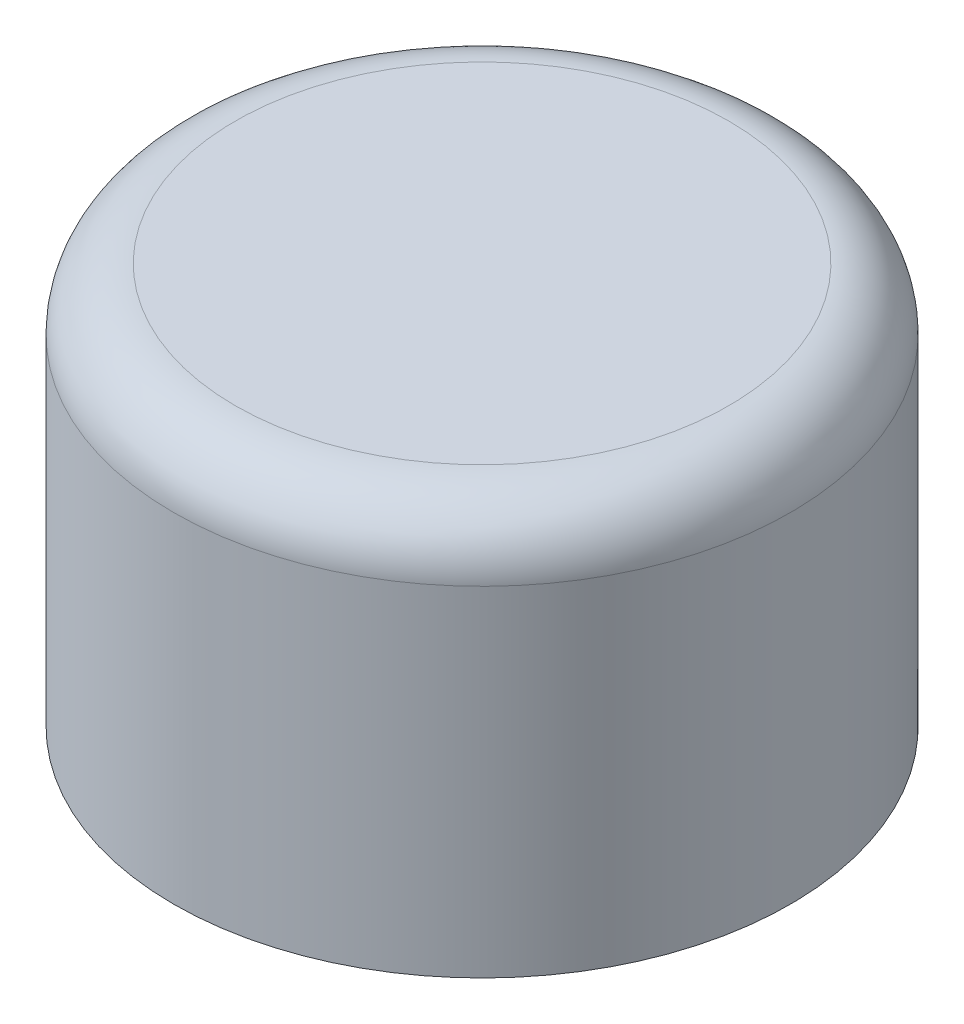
from build123d import *

# Parameters (mm, degrees)
SKIZZE1_R                       = 10
AUFSATZ_LINEAR_AUSTRAGEN1_DEPTH = 13
VERRUNDUNG1_R                   = 2


with BuildPart() as part:
    # Skizze1 → Aufsatz-Linear austragen1 (new body)
    with BuildSketch(Plane(origin=(0, 0, 0), x_dir=(1, 0, 0), z_dir=(0, 1, 0))):
        with Locations(Location((0, 0, 0), (0, 0, 270))):
            Circle(SKIZZE1_R)
    extrude(amount=AUFSATZ_LINEAR_AUSTRAGEN1_DEPTH)

    # Verrundung1
    verrundung1_edges = [part.edges().sort_by_distance(p)[0] for p in [
        (0, 13, -10),
    ]]
    fillet(verrundung1_edges, radius=VERRUNDUNG1_R)


solid = part.part
